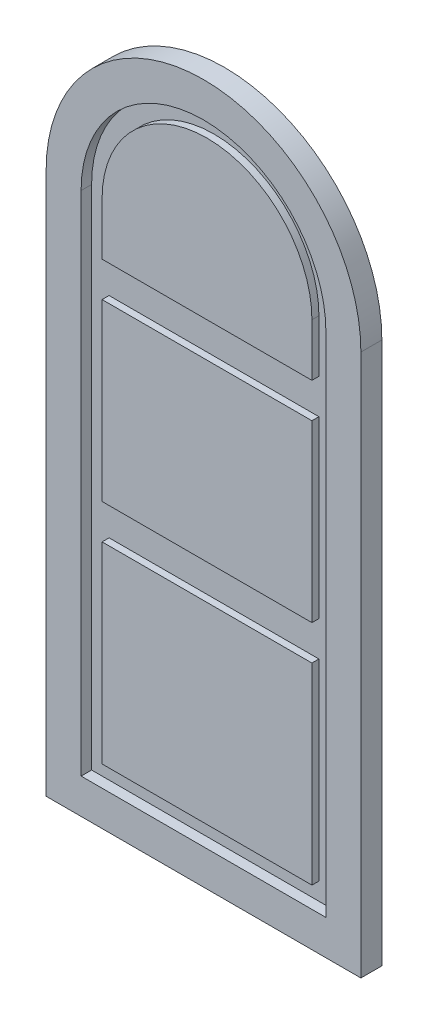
ISO-10303-21;
HEADER;
FILE_DESCRIPTION(('STEP AP214'),'2;1');
FILE_NAME('part.step','',(''),(''),'','','');
FILE_SCHEMA(('AUTOMOTIVE_DESIGN { 1 0 10303 214 1 1 1 1 }'));
ENDSEC;
DATA;
#1=APPLICATION_CONTEXT('core data for automotive mechanical design processes');
#2=APPLICATION_PROTOCOL_DEFINITION('international standard','automotive_design',2000,#1);
#3=PRODUCT_CONTEXT('',#1,'mechanical');
#4=PRODUCT('Part','Part','',(#3));
#5=PRODUCT_RELATED_PRODUCT_CATEGORY('part','',(#4));
#6=PRODUCT_DEFINITION_FORMATION('','',#4);
#7=PRODUCT_DEFINITION_CONTEXT('part definition',#1,'design');
#8=PRODUCT_DEFINITION('design','',#6,#7);
#9=PRODUCT_DEFINITION_SHAPE('','',#8);
#10=(LENGTH_UNIT() NAMED_UNIT(*) SI_UNIT(.MILLI.,.METRE.));
#11=(NAMED_UNIT(*) PLANE_ANGLE_UNIT() SI_UNIT($,.RADIAN.));
#12=(NAMED_UNIT(*) SI_UNIT($,.STERADIAN.) SOLID_ANGLE_UNIT());
#13=UNCERTAINTY_MEASURE_WITH_UNIT(LENGTH_MEASURE(1.E-05),#10,'distance_accuracy_value','');
#14=(GEOMETRIC_REPRESENTATION_CONTEXT(3) GLOBAL_UNCERTAINTY_ASSIGNED_CONTEXT((#13)) GLOBAL_UNIT_ASSIGNED_CONTEXT((#10,
#11,#12)) REPRESENTATION_CONTEXT('',''));
#15=CARTESIAN_POINT('',(0.,0.,0.));
#16=DIRECTION('',(0.,0.,1.));
#17=DIRECTION('',(1.,0.,0.));
#18=AXIS2_PLACEMENT_3D('',#15,#16,#17);
#19=CARTESIAN_POINT('',(405.722904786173,0.,60.));
#20=DIRECTION('',(1.,0.,0.));
#21=DIRECTION('',(0.,0.,-1.));
#22=AXIS2_PLACEMENT_3D('',#19,#20,#21);
#23=PLANE('',#22);
#24=DIRECTION('',(0.,-1.,0.));
#25=VECTOR('',#24,1.);
#26=CARTESIAN_POINT('',(405.722904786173,0.,0.));
#27=LINE('',#26,#25);
#28=CARTESIAN_POINT('',(405.722904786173,463.754283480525,0.));
#29=VERTEX_POINT('',#28);
#30=CARTESIAN_POINT('',(405.722904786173,-1086.24571651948,0.));
#31=VERTEX_POINT('',#30);
#32=EDGE_CURVE('E289',#29,#31,#27,.T.);
#33=ORIENTED_EDGE('',*,*,#32,.F.);
#34=DIRECTION('',(0.,0.,-1.));
#35=VECTOR('',#34,1.);
#36=CARTESIAN_POINT('',(405.722904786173,463.754283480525,60.));
#37=LINE('',#36,#35);
#38=CARTESIAN_POINT('',(405.722904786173,463.754283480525,60.));
#39=VERTEX_POINT('',#38);
#40=EDGE_CURVE('E11',#39,#29,#37,.T.);
#41=ORIENTED_EDGE('',*,*,#40,.F.);
#42=DIRECTION('',(0.,-1.,0.));
#43=VECTOR('',#42,1.);
#44=CARTESIAN_POINT('',(405.722904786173,0.,60.));
#45=LINE('',#44,#43);
#46=CARTESIAN_POINT('',(405.722904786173,-1086.24571651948,60.));
#47=VERTEX_POINT('',#46);
#48=EDGE_CURVE('E302',#39,#47,#45,.T.);
#49=ORIENTED_EDGE('',*,*,#48,.T.);
#50=DIRECTION('',(0.,0.,-1.));
#51=VECTOR('',#50,1.);
#52=CARTESIAN_POINT('',(405.722904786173,-1086.24571651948,60.));
#53=LINE('',#52,#51);
#54=EDGE_CURVE('E324',#47,#31,#53,.T.);
#55=ORIENTED_EDGE('',*,*,#54,.T.);
#56=EDGE_LOOP('',(#33,#41,#49,#55));
#57=FACE_BOUND('',#56,.T.);
#58=ADVANCED_FACE('F34',(#57),#23,.T.);
#59=CARTESIAN_POINT('',(-44.2770952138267,463.754283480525,60.));
#60=DIRECTION('',(0.,0.,-1.));
#61=DIRECTION('',(-1.,0.,0.));
#62=AXIS2_PLACEMENT_3D('',#59,#60,#61);
#63=CYLINDRICAL_SURFACE('',#62,450.);
#64=CARTESIAN_POINT('',(-44.2770952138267,463.754283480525,0.));
#65=DIRECTION('',(0.,0.,1.));
#66=DIRECTION('',(1.,0.,0.));
#67=AXIS2_PLACEMENT_3D('',#64,#65,#66);
#68=CIRCLE('',#67,450.);
#69=CARTESIAN_POINT('',(-494.277095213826,463.754283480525,0.));
#70=VERTEX_POINT('',#69);
#71=EDGE_CURVE('E316',#29,#70,#68,.T.);
#72=ORIENTED_EDGE('',*,*,#71,.T.);
#73=DIRECTION('',(0.,0.,-1.));
#74=VECTOR('',#73,1.);
#75=CARTESIAN_POINT('',(-494.277095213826,463.754283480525,60.));
#76=LINE('',#75,#74);
#77=CARTESIAN_POINT('',(-494.277095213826,463.754283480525,60.));
#78=VERTEX_POINT('',#77);
#79=EDGE_CURVE('E43',#78,#70,#76,.T.);
#80=ORIENTED_EDGE('',*,*,#79,.F.);
#81=CARTESIAN_POINT('',(-44.2770952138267,463.754283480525,60.));
#82=DIRECTION('',(0.,0.,1.));
#83=DIRECTION('',(1.,0.,0.));
#84=AXIS2_PLACEMENT_3D('',#81,#82,#83);
#85=CIRCLE('',#84,450.);
#86=EDGE_CURVE('E305',#39,#78,#85,.T.);
#87=ORIENTED_EDGE('',*,*,#86,.F.);
#88=ORIENTED_EDGE('',*,*,#40,.T.);
#89=EDGE_LOOP('',(#72,#80,#87,#88));
#90=FACE_BOUND('',#89,.T.);
#91=ADVANCED_FACE('F355',(#90),#63,.T.);
#92=CARTESIAN_POINT('',(-494.277095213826,0.,60.));
#93=DIRECTION('',(1.,0.,0.));
#94=DIRECTION('',(0.,1.,0.));
#95=AXIS2_PLACEMENT_3D('',#92,#93,#94);
#96=PLANE('',#95);
#97=DIRECTION('',(0.,-1.,0.));
#98=VECTOR('',#97,1.);
#99=CARTESIAN_POINT('',(-494.277095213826,0.,0.));
#100=LINE('',#99,#98);
#101=CARTESIAN_POINT('',(-494.277095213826,-1086.24571651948,0.));
#102=VERTEX_POINT('',#101);
#103=EDGE_CURVE('E319',#70,#102,#100,.T.);
#104=ORIENTED_EDGE('',*,*,#103,.T.);
#105=DIRECTION('',(0.,0.,-1.));
#106=VECTOR('',#105,1.);
#107=CARTESIAN_POINT('',(-494.277095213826,-1086.24571651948,60.));
#108=LINE('',#107,#106);
#109=CARTESIAN_POINT('',(-494.277095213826,-1086.24571651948,60.));
#110=VERTEX_POINT('',#109);
#111=EDGE_CURVE('E326',#110,#102,#108,.T.);
#112=ORIENTED_EDGE('',*,*,#111,.F.);
#113=DIRECTION('',(0.,-1.,0.));
#114=VECTOR('',#113,1.);
#115=CARTESIAN_POINT('',(-494.277095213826,0.,60.));
#116=LINE('',#115,#114);
#117=EDGE_CURVE('E308',#78,#110,#116,.T.);
#118=ORIENTED_EDGE('',*,*,#117,.F.);
#119=ORIENTED_EDGE('',*,*,#79,.T.);
#120=EDGE_LOOP('',(#104,#112,#118,#119));
#121=FACE_BOUND('',#120,.T.);
#122=ADVANCED_FACE('F350',(#121),#96,.F.);
#123=CARTESIAN_POINT('',(-44.2770952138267,463.754283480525,60.));
#124=DIRECTION('',(0.,0.,-1.));
#125=DIRECTION('',(-1.,0.,0.));
#126=AXIS2_PLACEMENT_3D('',#123,#124,#125);
#127=CYLINDRICAL_SURFACE('',#126,350.);
#128=CARTESIAN_POINT('',(-44.2770952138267,463.754283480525,30.));
#129=DIRECTION('',(0.,0.,1.));
#130=DIRECTION('',(1.,0.,0.));
#131=AXIS2_PLACEMENT_3D('',#128,#129,#130);
#132=CIRCLE('',#131,350.);
#133=CARTESIAN_POINT('',(305.722904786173,463.754283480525,30.));
#134=VERTEX_POINT('',#133);
#135=CARTESIAN_POINT('',(-394.277095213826,463.754283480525,30.));
#136=VERTEX_POINT('',#135);
#137=EDGE_CURVE('E51',#134,#136,#132,.T.);
#138=ORIENTED_EDGE('',*,*,#137,.F.);
#139=DIRECTION('',(0.,0.,-1.));
#140=VECTOR('',#139,1.);
#141=CARTESIAN_POINT('',(305.722904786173,463.754283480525,60.));
#142=LINE('',#141,#140);
#143=CARTESIAN_POINT('',(305.722904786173,463.754283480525,60.));
#144=VERTEX_POINT('',#143);
#145=EDGE_CURVE('E38',#144,#134,#142,.T.);
#146=ORIENTED_EDGE('',*,*,#145,.F.);
#147=CARTESIAN_POINT('',(-44.2770952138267,463.754283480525,60.));
#148=DIRECTION('',(0.,0.,1.));
#149=DIRECTION('',(1.,0.,0.));
#150=AXIS2_PLACEMENT_3D('',#147,#148,#149);
#151=CIRCLE('',#150,350.);
#152=CARTESIAN_POINT('',(-394.277095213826,463.754283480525,60.));
#153=VERTEX_POINT('',#152);
#154=EDGE_CURVE('E290',#144,#153,#151,.T.);
#155=ORIENTED_EDGE('',*,*,#154,.T.);
#156=DIRECTION('',(0.,0.,-1.));
#157=VECTOR('',#156,1.);
#158=CARTESIAN_POINT('',(-394.277095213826,463.754283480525,60.));
#159=LINE('',#158,#157);
#160=EDGE_CURVE('E313',#153,#136,#159,.T.);
#161=ORIENTED_EDGE('',*,*,#160,.T.);
#162=EDGE_LOOP('',(#138,#146,#155,#161));
#163=FACE_BOUND('',#162,.T.);
#164=ADVANCED_FACE('F36',(#163),#127,.F.);
#165=CARTESIAN_POINT('',(305.722904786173,0.,60.));
#166=DIRECTION('',(1.,0.,0.));
#167=DIRECTION('',(0.,0.,-1.));
#168=AXIS2_PLACEMENT_3D('',#165,#166,#167);
#169=PLANE('',#168);
#170=ORIENTED_EDGE('',*,*,#145,.T.);
#171=DIRECTION('',(0.,-1.,0.));
#172=VECTOR('',#171,1.);
#173=CARTESIAN_POINT('',(305.722904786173,0.,30.));
#174=LINE('',#173,#172);
#175=CARTESIAN_POINT('',(305.722904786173,-986.245716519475,30.));
#176=VERTEX_POINT('',#175);
#177=EDGE_CURVE('E58',#134,#176,#174,.T.);
#178=ORIENTED_EDGE('',*,*,#177,.T.);
#179=DIRECTION('',(0.,0.,-1.));
#180=VECTOR('',#179,1.);
#181=CARTESIAN_POINT('',(305.722904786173,-986.245716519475,60.));
#182=LINE('',#181,#180);
#183=CARTESIAN_POINT('',(305.722904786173,-986.245716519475,60.));
#184=VERTEX_POINT('',#183);
#185=EDGE_CURVE('E333',#184,#176,#182,.T.);
#186=ORIENTED_EDGE('',*,*,#185,.F.);
#187=DIRECTION('',(0.,-1.,0.));
#188=VECTOR('',#187,1.);
#189=CARTESIAN_POINT('',(305.722904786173,0.,60.));
#190=LINE('',#189,#188);
#191=EDGE_CURVE('E293',#144,#184,#190,.T.);
#192=ORIENTED_EDGE('',*,*,#191,.F.);
#193=EDGE_LOOP('',(#170,#178,#186,#192));
#194=FACE_BOUND('',#193,.T.);
#195=ADVANCED_FACE('F337',(#194),#169,.F.);
#196=CARTESIAN_POINT('',(1.56421814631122E-13,-986.245716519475,60.));
#197=DIRECTION('',(0.,1.,0.));
#198=DIRECTION('',(-1.,0.,0.));
#199=AXIS2_PLACEMENT_3D('',#196,#197,#198);
#200=PLANE('',#199);
#201=DIRECTION('',(1.,0.,0.));
#202=VECTOR('',#201,1.);
#203=CARTESIAN_POINT('',(1.56421814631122E-13,-986.245716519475,30.));
#204=LINE('',#203,#202);
#205=CARTESIAN_POINT('',(-394.277095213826,-986.245716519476,30.));
#206=VERTEX_POINT('',#205);
#207=EDGE_CURVE('E286',#206,#176,#204,.T.);
#208=ORIENTED_EDGE('',*,*,#207,.F.);
#209=DIRECTION('',(0.,0.,-1.));
#210=VECTOR('',#209,1.);
#211=CARTESIAN_POINT('',(-394.277095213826,-986.245716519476,60.));
#212=LINE('',#211,#210);
#213=CARTESIAN_POINT('',(-394.277095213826,-986.245716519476,60.));
#214=VERTEX_POINT('',#213);
#215=EDGE_CURVE('E332',#214,#206,#212,.T.);
#216=ORIENTED_EDGE('',*,*,#215,.F.);
#217=DIRECTION('',(1.,0.,0.));
#218=VECTOR('',#217,1.);
#219=CARTESIAN_POINT('',(1.56421814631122E-13,-986.245716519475,60.));
#220=LINE('',#219,#218);
#221=EDGE_CURVE('E296',#214,#184,#220,.T.);
#222=ORIENTED_EDGE('',*,*,#221,.T.);
#223=ORIENTED_EDGE('',*,*,#185,.T.);
#224=EDGE_LOOP('',(#208,#216,#222,#223));
#225=FACE_BOUND('',#224,.T.);
#226=ADVANCED_FACE('F341',(#225),#200,.T.);
#227=CARTESIAN_POINT('',(-394.277095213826,0.,60.));
#228=DIRECTION('',(1.,0.,0.));
#229=DIRECTION('',(0.,0.,-1.));
#230=AXIS2_PLACEMENT_3D('',#227,#228,#229);
#231=PLANE('',#230);
#232=DIRECTION('',(0.,-1.,0.));
#233=VECTOR('',#232,1.);
#234=CARTESIAN_POINT('',(-394.277095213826,0.,30.));
#235=LINE('',#234,#233);
#236=EDGE_CURVE('E283',#136,#206,#235,.T.);
#237=ORIENTED_EDGE('',*,*,#236,.F.);
#238=ORIENTED_EDGE('',*,*,#160,.F.);
#239=DIRECTION('',(0.,-1.,0.));
#240=VECTOR('',#239,1.);
#241=CARTESIAN_POINT('',(-394.277095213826,0.,60.));
#242=LINE('',#241,#240);
#243=EDGE_CURVE('E299',#153,#214,#242,.T.);
#244=ORIENTED_EDGE('',*,*,#243,.T.);
#245=ORIENTED_EDGE('',*,*,#215,.T.);
#246=EDGE_LOOP('',(#237,#238,#244,#245));
#247=FACE_BOUND('',#246,.T.);
#248=ADVANCED_FACE('F348',(#247),#231,.T.);
#249=CARTESIAN_POINT('',(0.,-1086.24571651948,60.));
#250=DIRECTION('',(0.,1.,0.));
#251=DIRECTION('',(0.,0.,1.));
#252=AXIS2_PLACEMENT_3D('',#249,#250,#251);
#253=PLANE('',#252);
#254=DIRECTION('',(1.,0.,0.));
#255=VECTOR('',#254,1.);
#256=CARTESIAN_POINT('',(0.,-1086.24571651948,0.));
#257=LINE('',#256,#255);
#258=EDGE_CURVE('E294',#102,#31,#257,.T.);
#259=ORIENTED_EDGE('',*,*,#258,.T.);
#260=ORIENTED_EDGE('',*,*,#54,.F.);
#261=DIRECTION('',(1.,0.,0.));
#262=VECTOR('',#261,1.);
#263=CARTESIAN_POINT('',(0.,-1086.24571651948,60.));
#264=LINE('',#263,#262);
#265=EDGE_CURVE('E311',#110,#47,#264,.T.);
#266=ORIENTED_EDGE('',*,*,#265,.F.);
#267=ORIENTED_EDGE('',*,*,#111,.T.);
#268=EDGE_LOOP('',(#259,#260,#266,#267));
#269=FACE_BOUND('',#268,.T.);
#270=ADVANCED_FACE('F370',(#269),#253,.F.);
#271=CARTESIAN_POINT('',(0.,0.,60.));
#272=DIRECTION('',(0.,0.,1.));
#273=DIRECTION('',(1.,0.,0.));
#274=AXIS2_PLACEMENT_3D('',#271,#272,#273);
#275=PLANE('',#274);
#276=ORIENTED_EDGE('',*,*,#154,.F.);
#277=ORIENTED_EDGE('',*,*,#191,.T.);
#278=ORIENTED_EDGE('',*,*,#221,.F.);
#279=ORIENTED_EDGE('',*,*,#243,.F.);
#280=EDGE_LOOP('',(#276,#277,#278,#279));
#281=FACE_BOUND('',#280,.T.);
#282=ORIENTED_EDGE('',*,*,#48,.F.);
#283=ORIENTED_EDGE('',*,*,#86,.T.);
#284=ORIENTED_EDGE('',*,*,#117,.T.);
#285=ORIENTED_EDGE('',*,*,#265,.T.);
#286=EDGE_LOOP('',(#282,#283,#284,#285));
#287=FACE_BOUND('',#286,.T.);
#288=ADVANCED_FACE('F346',(#281,#287),#275,.T.);
#289=CARTESIAN_POINT('',(0.,0.,0.));
#290=DIRECTION('',(0.,0.,1.));
#291=DIRECTION('',(1.,0.,0.));
#292=AXIS2_PLACEMENT_3D('',#289,#290,#291);
#293=PLANE('',#292);
#294=ORIENTED_EDGE('',*,*,#32,.T.);
#295=ORIENTED_EDGE('',*,*,#258,.F.);
#296=ORIENTED_EDGE('',*,*,#103,.F.);
#297=ORIENTED_EDGE('',*,*,#71,.F.);
#298=EDGE_LOOP('',(#294,#295,#296,#297));
#299=FACE_BOUND('',#298,.T.);
#300=ADVANCED_FACE('F395',(#299),#293,.F.);
#301=CARTESIAN_POINT('',(0.,0.,30.));
#302=DIRECTION('',(0.,0.,1.));
#303=DIRECTION('',(1.,0.,0.));
#304=AXIS2_PLACEMENT_3D('',#301,#302,#303);
#305=PLANE('',#304);
#306=CARTESIAN_POINT('',(-44.2770952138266,463.754283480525,30.));
#307=DIRECTION('',(0.,0.,1.));
#308=DIRECTION('',(1.,0.,0.));
#309=AXIS2_PLACEMENT_3D('',#306,#307,#308);
#310=CIRCLE('',#309,300.);
#311=CARTESIAN_POINT('',(255.722904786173,463.754283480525,30.));
#312=VERTEX_POINT('',#311);
#313=CARTESIAN_POINT('',(-344.277095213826,463.754283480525,30.));
#314=VERTEX_POINT('',#313);
#315=EDGE_CURVE('E251',#312,#314,#310,.T.);
#316=ORIENTED_EDGE('',*,*,#315,.F.);
#317=DIRECTION('',(0.,1.,0.));
#318=VECTOR('',#317,1.);
#319=CARTESIAN_POINT('',(255.722904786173,0.,30.));
#320=LINE('',#319,#318);
#321=CARTESIAN_POINT('',(255.722904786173,313.754283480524,30.));
#322=VERTEX_POINT('',#321);
#323=EDGE_CURVE('E254',#322,#312,#320,.T.);
#324=ORIENTED_EDGE('',*,*,#323,.F.);
#325=DIRECTION('',(1.,0.,0.));
#326=VECTOR('',#325,1.);
#327=CARTESIAN_POINT('',(0.,313.754283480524,30.));
#328=LINE('',#327,#326);
#329=CARTESIAN_POINT('',(-344.277095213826,313.754283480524,30.));
#330=VERTEX_POINT('',#329);
#331=EDGE_CURVE('E257',#330,#322,#328,.T.);
#332=ORIENTED_EDGE('',*,*,#331,.F.);
#333=DIRECTION('',(0.,1.,0.));
#334=VECTOR('',#333,1.);
#335=CARTESIAN_POINT('',(-344.277095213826,0.,30.));
#336=LINE('',#335,#334);
#337=EDGE_CURVE('E260',#330,#314,#336,.T.);
#338=ORIENTED_EDGE('',*,*,#337,.T.);
#339=EDGE_LOOP('',(#316,#324,#332,#338));
#340=FACE_BOUND('',#339,.T.);
#341=DIRECTION('',(1.,0.,0.));
#342=VECTOR('',#341,1.);
#343=CARTESIAN_POINT('',(0.,-936.245716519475,30.));
#344=LINE('',#343,#342);
#345=CARTESIAN_POINT('',(-344.277095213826,-936.245716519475,30.));
#346=VERTEX_POINT('',#345);
#347=CARTESIAN_POINT('',(255.722904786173,-936.245716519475,30.));
#348=VERTEX_POINT('',#347);
#349=EDGE_CURVE('E262',#346,#348,#344,.T.);
#350=ORIENTED_EDGE('',*,*,#349,.F.);
#351=DIRECTION('',(0.,1.,0.));
#352=VECTOR('',#351,1.);
#353=CARTESIAN_POINT('',(-344.277095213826,0.,30.));
#354=LINE('',#353,#352);
#355=CARTESIAN_POINT('',(-344.277095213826,-386.245716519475,30.));
#356=VERTEX_POINT('',#355);
#357=EDGE_CURVE('E182',#346,#356,#354,.T.);
#358=ORIENTED_EDGE('',*,*,#357,.T.);
#359=DIRECTION('',(1.,0.,0.));
#360=VECTOR('',#359,1.);
#361=CARTESIAN_POINT('',(0.,-386.245716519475,30.));
#362=LINE('',#361,#360);
#363=CARTESIAN_POINT('',(255.722904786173,-386.245716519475,30.));
#364=VERTEX_POINT('',#363);
#365=EDGE_CURVE('E265',#356,#364,#362,.T.);
#366=ORIENTED_EDGE('',*,*,#365,.T.);
#367=DIRECTION('',(0.,1.,0.));
#368=VECTOR('',#367,1.);
#369=CARTESIAN_POINT('',(255.722904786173,0.,30.));
#370=LINE('',#369,#368);
#371=EDGE_CURVE('E268',#348,#364,#370,.T.);
#372=ORIENTED_EDGE('',*,*,#371,.F.);
#373=EDGE_LOOP('',(#350,#358,#366,#372));
#374=FACE_BOUND('',#373,.T.);
#375=DIRECTION('',(0.,1.,0.));
#376=VECTOR('',#375,1.);
#377=CARTESIAN_POINT('',(255.722904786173,0.,30.));
#378=LINE('',#377,#376);
#379=CARTESIAN_POINT('',(255.722904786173,-286.245716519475,30.));
#380=VERTEX_POINT('',#379);
#381=CARTESIAN_POINT('',(255.722904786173,213.754283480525,30.));
#382=VERTEX_POINT('',#381);
#383=EDGE_CURVE('E271',#380,#382,#378,.T.);
#384=ORIENTED_EDGE('',*,*,#383,.F.);
#385=DIRECTION('',(1.,0.,0.));
#386=VECTOR('',#385,1.);
#387=CARTESIAN_POINT('',(0.,-286.245716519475,30.));
#388=LINE('',#387,#386);
#389=CARTESIAN_POINT('',(-344.277095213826,-286.245716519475,30.));
#390=VERTEX_POINT('',#389);
#391=EDGE_CURVE('E273',#390,#380,#388,.T.);
#392=ORIENTED_EDGE('',*,*,#391,.F.);
#393=DIRECTION('',(0.,1.,0.));
#394=VECTOR('',#393,1.);
#395=CARTESIAN_POINT('',(-344.277095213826,0.,30.));
#396=LINE('',#395,#394);
#397=CARTESIAN_POINT('',(-344.277095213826,213.754283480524,30.));
#398=VERTEX_POINT('',#397);
#399=EDGE_CURVE('E275',#390,#398,#396,.T.);
#400=ORIENTED_EDGE('',*,*,#399,.T.);
#401=DIRECTION('',(1.,0.,0.));
#402=VECTOR('',#401,1.);
#403=CARTESIAN_POINT('',(0.,213.754283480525,30.));
#404=LINE('',#403,#402);
#405=EDGE_CURVE('E278',#398,#382,#404,.T.);
#406=ORIENTED_EDGE('',*,*,#405,.T.);
#407=EDGE_LOOP('',(#384,#392,#400,#406));
#408=FACE_BOUND('',#407,.T.);
#409=ORIENTED_EDGE('',*,*,#177,.F.);
#410=ORIENTED_EDGE('',*,*,#137,.T.);
#411=ORIENTED_EDGE('',*,*,#236,.T.);
#412=ORIENTED_EDGE('',*,*,#207,.T.);
#413=EDGE_LOOP('',(#409,#410,#411,#412));
#414=FACE_BOUND('',#413,.T.);
#415=ADVANCED_FACE('F340',(#340,#374,#408,#414),#305,.T.);
#416=CARTESIAN_POINT('',(0.,0.,50.));
#417=DIRECTION('',(0.,0.,1.));
#418=DIRECTION('',(1.,0.,0.));
#419=AXIS2_PLACEMENT_3D('',#416,#417,#418);
#420=PLANE('',#419);
#421=DIRECTION('',(0.,1.,0.));
#422=VECTOR('',#421,1.);
#423=CARTESIAN_POINT('',(255.722904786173,0.,50.));
#424=LINE('',#423,#422);
#425=CARTESIAN_POINT('',(255.722904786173,313.754283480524,50.));
#426=VERTEX_POINT('',#425);
#427=CARTESIAN_POINT('',(255.722904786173,463.754283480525,50.));
#428=VERTEX_POINT('',#427);
#429=EDGE_CURVE('E229',#426,#428,#424,.T.);
#430=ORIENTED_EDGE('',*,*,#429,.T.);
#431=CARTESIAN_POINT('',(-44.2770952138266,463.754283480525,50.));
#432=DIRECTION('',(0.,0.,1.));
#433=DIRECTION('',(1.,0.,0.));
#434=AXIS2_PLACEMENT_3D('',#431,#432,#433);
#435=CIRCLE('',#434,300.);
#436=CARTESIAN_POINT('',(-344.277095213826,463.754283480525,50.));
#437=VERTEX_POINT('',#436);
#438=EDGE_CURVE('E232',#428,#437,#435,.T.);
#439=ORIENTED_EDGE('',*,*,#438,.T.);
#440=DIRECTION('',(0.,1.,0.));
#441=VECTOR('',#440,1.);
#442=CARTESIAN_POINT('',(-344.277095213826,0.,50.));
#443=LINE('',#442,#441);
#444=CARTESIAN_POINT('',(-344.277095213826,313.754283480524,50.));
#445=VERTEX_POINT('',#444);
#446=EDGE_CURVE('E234',#445,#437,#443,.T.);
#447=ORIENTED_EDGE('',*,*,#446,.F.);
#448=DIRECTION('',(1.,0.,0.));
#449=VECTOR('',#448,1.);
#450=CARTESIAN_POINT('',(0.,313.754283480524,50.));
#451=LINE('',#450,#449);
#452=EDGE_CURVE('E237',#445,#426,#451,.T.);
#453=ORIENTED_EDGE('',*,*,#452,.T.);
#454=EDGE_LOOP('',(#430,#439,#447,#453));
#455=FACE_BOUND('',#454,.T.);
#456=ADVANCED_FACE('F408',(#455),#420,.T.);
#457=CARTESIAN_POINT('',(0.,313.754283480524,50.));
#458=DIRECTION('',(0.,1.,0.));
#459=DIRECTION('',(0.,0.,1.));
#460=AXIS2_PLACEMENT_3D('',#457,#458,#459);
#461=PLANE('',#460);
#462=ORIENTED_EDGE('',*,*,#331,.T.);
#463=DIRECTION('',(0.,0.,-1.));
#464=VECTOR('',#463,1.);
#465=CARTESIAN_POINT('',(255.722904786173,313.754283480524,50.));
#466=LINE('',#465,#464);
#467=EDGE_CURVE('E239',#426,#322,#466,.T.);
#468=ORIENTED_EDGE('',*,*,#467,.F.);
#469=ORIENTED_EDGE('',*,*,#452,.F.);
#470=DIRECTION('',(0.,0.,-1.));
#471=VECTOR('',#470,1.);
#472=CARTESIAN_POINT('',(-344.277095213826,313.754283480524,50.));
#473=LINE('',#472,#471);
#474=EDGE_CURVE('E242',#445,#330,#473,.T.);
#475=ORIENTED_EDGE('',*,*,#474,.T.);
#476=EDGE_LOOP('',(#462,#468,#469,#475));
#477=FACE_BOUND('',#476,.T.);
#478=ADVANCED_FACE('F416',(#477),#461,.F.);
#479=CARTESIAN_POINT('',(-344.277095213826,0.,50.));
#480=DIRECTION('',(-1.,0.,0.));
#481=DIRECTION('',(0.,0.,1.));
#482=AXIS2_PLACEMENT_3D('',#479,#480,#481);
#483=PLANE('',#482);
#484=DIRECTION('',(0.,0.,-1.));
#485=VECTOR('',#484,1.);
#486=CARTESIAN_POINT('',(-344.277095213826,463.754283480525,50.));
#487=LINE('',#486,#485);
#488=EDGE_CURVE('E245',#437,#314,#487,.T.);
#489=ORIENTED_EDGE('',*,*,#488,.T.);
#490=ORIENTED_EDGE('',*,*,#337,.F.);
#491=ORIENTED_EDGE('',*,*,#474,.F.);
#492=ORIENTED_EDGE('',*,*,#446,.T.);
#493=EDGE_LOOP('',(#489,#490,#491,#492));
#494=FACE_BOUND('',#493,.T.);
#495=ADVANCED_FACE('F424',(#494),#483,.T.);
#496=CARTESIAN_POINT('',(-44.2770952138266,463.754283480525,50.));
#497=DIRECTION('',(0.,0.,-1.));
#498=DIRECTION('',(-1.,0.,0.));
#499=AXIS2_PLACEMENT_3D('',#496,#497,#498);
#500=CYLINDRICAL_SURFACE('',#499,300.);
#501=ORIENTED_EDGE('',*,*,#315,.T.);
#502=ORIENTED_EDGE('',*,*,#488,.F.);
#503=ORIENTED_EDGE('',*,*,#438,.F.);
#504=DIRECTION('',(0.,0.,-1.));
#505=VECTOR('',#504,1.);
#506=CARTESIAN_POINT('',(255.722904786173,463.754283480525,50.));
#507=LINE('',#506,#505);
#508=EDGE_CURVE('E248',#428,#312,#507,.T.);
#509=ORIENTED_EDGE('',*,*,#508,.T.);
#510=EDGE_LOOP('',(#501,#502,#503,#509));
#511=FACE_BOUND('',#510,.T.);
#512=ADVANCED_FACE('F432',(#511),#500,.T.);
#513=CARTESIAN_POINT('',(255.722904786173,0.,50.));
#514=DIRECTION('',(-1.,0.,0.));
#515=DIRECTION('',(0.,0.,1.));
#516=AXIS2_PLACEMENT_3D('',#513,#514,#515);
#517=PLANE('',#516);
#518=ORIENTED_EDGE('',*,*,#323,.T.);
#519=ORIENTED_EDGE('',*,*,#508,.F.);
#520=ORIENTED_EDGE('',*,*,#429,.F.);
#521=ORIENTED_EDGE('',*,*,#467,.T.);
#522=EDGE_LOOP('',(#518,#519,#520,#521));
#523=FACE_BOUND('',#522,.T.);
#524=ADVANCED_FACE('F440',(#523),#517,.F.);
#525=CARTESIAN_POINT('',(0.,0.,50.));
#526=DIRECTION('',(0.,0.,1.));
#527=DIRECTION('',(1.,0.,0.));
#528=AXIS2_PLACEMENT_3D('',#525,#526,#527);
#529=PLANE('',#528);
#530=DIRECTION('',(1.,0.,0.));
#531=VECTOR('',#530,1.);
#532=CARTESIAN_POINT('',(0.,-286.245716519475,50.));
#533=LINE('',#532,#531);
#534=CARTESIAN_POINT('',(-344.277095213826,-286.245716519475,50.));
#535=VERTEX_POINT('',#534);
#536=CARTESIAN_POINT('',(255.722904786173,-286.245716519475,50.));
#537=VERTEX_POINT('',#536);
#538=EDGE_CURVE('E185',#535,#537,#533,.T.);
#539=ORIENTED_EDGE('',*,*,#538,.T.);
#540=DIRECTION('',(0.,1.,0.));
#541=VECTOR('',#540,1.);
#542=CARTESIAN_POINT('',(255.722904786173,0.,50.));
#543=LINE('',#542,#541);
#544=CARTESIAN_POINT('',(255.722904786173,213.754283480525,50.));
#545=VERTEX_POINT('',#544);
#546=EDGE_CURVE('E210',#537,#545,#543,.T.);
#547=ORIENTED_EDGE('',*,*,#546,.T.);
#548=DIRECTION('',(1.,0.,0.));
#549=VECTOR('',#548,1.);
#550=CARTESIAN_POINT('',(0.,213.754283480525,50.));
#551=LINE('',#550,#549);
#552=CARTESIAN_POINT('',(-344.277095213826,213.754283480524,50.));
#553=VERTEX_POINT('',#552);
#554=EDGE_CURVE('E212',#553,#545,#551,.T.);
#555=ORIENTED_EDGE('',*,*,#554,.F.);
#556=DIRECTION('',(0.,1.,0.));
#557=VECTOR('',#556,1.);
#558=CARTESIAN_POINT('',(-344.277095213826,0.,50.));
#559=LINE('',#558,#557);
#560=EDGE_CURVE('E215',#535,#553,#559,.T.);
#561=ORIENTED_EDGE('',*,*,#560,.F.);
#562=EDGE_LOOP('',(#539,#547,#555,#561));
#563=FACE_BOUND('',#562,.T.);
#564=ADVANCED_FACE('F448',(#563),#529,.T.);
#565=CARTESIAN_POINT('',(-344.277095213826,0.,50.));
#566=DIRECTION('',(-1.,0.,0.));
#567=DIRECTION('',(0.,0.,1.));
#568=AXIS2_PLACEMENT_3D('',#565,#566,#567);
#569=PLANE('',#568);
#570=DIRECTION('',(0.,0.,-1.));
#571=VECTOR('',#570,1.);
#572=CARTESIAN_POINT('',(-344.277095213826,213.754283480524,50.));
#573=LINE('',#572,#571);
#574=EDGE_CURVE('E221',#553,#398,#573,.T.);
#575=ORIENTED_EDGE('',*,*,#574,.T.);
#576=ORIENTED_EDGE('',*,*,#399,.F.);
#577=DIRECTION('',(0.,0.,-1.));
#578=VECTOR('',#577,1.);
#579=CARTESIAN_POINT('',(-344.277095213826,-286.245716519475,50.));
#580=LINE('',#579,#578);
#581=EDGE_CURVE('E218',#535,#390,#580,.T.);
#582=ORIENTED_EDGE('',*,*,#581,.F.);
#583=ORIENTED_EDGE('',*,*,#560,.T.);
#584=EDGE_LOOP('',(#575,#576,#582,#583));
#585=FACE_BOUND('',#584,.T.);
#586=ADVANCED_FACE('F456',(#585),#569,.T.);
#587=CARTESIAN_POINT('',(0.,213.754283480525,50.));
#588=DIRECTION('',(0.,1.,0.));
#589=DIRECTION('',(-1.,0.,0.));
#590=AXIS2_PLACEMENT_3D('',#587,#588,#589);
#591=PLANE('',#590);
#592=DIRECTION('',(0.,0.,-1.));
#593=VECTOR('',#592,1.);
#594=CARTESIAN_POINT('',(255.722904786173,213.754283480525,50.));
#595=LINE('',#594,#593);
#596=EDGE_CURVE('E223',#545,#382,#595,.T.);
#597=ORIENTED_EDGE('',*,*,#596,.T.);
#598=ORIENTED_EDGE('',*,*,#405,.F.);
#599=ORIENTED_EDGE('',*,*,#574,.F.);
#600=ORIENTED_EDGE('',*,*,#554,.T.);
#601=EDGE_LOOP('',(#597,#598,#599,#600));
#602=FACE_BOUND('',#601,.T.);
#603=ADVANCED_FACE('F464',(#602),#591,.T.);
#604=CARTESIAN_POINT('',(255.722904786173,0.,50.));
#605=DIRECTION('',(-1.,0.,0.));
#606=DIRECTION('',(0.,-1.,0.));
#607=AXIS2_PLACEMENT_3D('',#604,#605,#606);
#608=PLANE('',#607);
#609=ORIENTED_EDGE('',*,*,#383,.T.);
#610=ORIENTED_EDGE('',*,*,#596,.F.);
#611=ORIENTED_EDGE('',*,*,#546,.F.);
#612=DIRECTION('',(0.,0.,-1.));
#613=VECTOR('',#612,1.);
#614=CARTESIAN_POINT('',(255.722904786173,-286.245716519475,50.));
#615=LINE('',#614,#613);
#616=EDGE_CURVE('E226',#537,#380,#615,.T.);
#617=ORIENTED_EDGE('',*,*,#616,.T.);
#618=EDGE_LOOP('',(#609,#610,#611,#617));
#619=FACE_BOUND('',#618,.T.);
#620=ADVANCED_FACE('F472',(#619),#608,.F.);
#621=CARTESIAN_POINT('',(0.,-286.245716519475,50.));
#622=DIRECTION('',(0.,1.,0.));
#623=DIRECTION('',(0.,0.,1.));
#624=AXIS2_PLACEMENT_3D('',#621,#622,#623);
#625=PLANE('',#624);
#626=ORIENTED_EDGE('',*,*,#391,.T.);
#627=ORIENTED_EDGE('',*,*,#616,.F.);
#628=ORIENTED_EDGE('',*,*,#538,.F.);
#629=ORIENTED_EDGE('',*,*,#581,.T.);
#630=EDGE_LOOP('',(#626,#627,#628,#629));
#631=FACE_BOUND('',#630,.T.);
#632=ADVANCED_FACE('F480',(#631),#625,.F.);
#633=CARTESIAN_POINT('',(0.,0.,50.));
#634=DIRECTION('',(0.,0.,1.));
#635=DIRECTION('',(1.,0.,0.));
#636=AXIS2_PLACEMENT_3D('',#633,#634,#635);
#637=PLANE('',#636);
#638=DIRECTION('',(0.,1.,0.));
#639=VECTOR('',#638,1.);
#640=CARTESIAN_POINT('',(-344.277095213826,0.,50.));
#641=LINE('',#640,#639);
#642=CARTESIAN_POINT('',(-344.277095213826,-936.245716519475,50.));
#643=VERTEX_POINT('',#642);
#644=CARTESIAN_POINT('',(-344.277095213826,-386.245716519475,50.));
#645=VERTEX_POINT('',#644);
#646=EDGE_CURVE('E179',#643,#645,#641,.T.);
#647=ORIENTED_EDGE('',*,*,#646,.F.);
#648=DIRECTION('',(1.,0.,0.));
#649=VECTOR('',#648,1.);
#650=CARTESIAN_POINT('',(0.,-936.245716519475,50.));
#651=LINE('',#650,#649);
#652=CARTESIAN_POINT('',(255.722904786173,-936.245716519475,50.));
#653=VERTEX_POINT('',#652);
#654=EDGE_CURVE('E189',#643,#653,#651,.T.);
#655=ORIENTED_EDGE('',*,*,#654,.T.);
#656=DIRECTION('',(0.,1.,0.));
#657=VECTOR('',#656,1.);
#658=CARTESIAN_POINT('',(255.722904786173,0.,50.));
#659=LINE('',#658,#657);
#660=CARTESIAN_POINT('',(255.722904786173,-386.245716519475,50.));
#661=VERTEX_POINT('',#660);
#662=EDGE_CURVE('E194',#653,#661,#659,.T.);
#663=ORIENTED_EDGE('',*,*,#662,.T.);
#664=DIRECTION('',(1.,0.,0.));
#665=VECTOR('',#664,1.);
#666=CARTESIAN_POINT('',(0.,-386.245716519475,50.));
#667=LINE('',#666,#665);
#668=EDGE_CURVE('E198',#645,#661,#667,.T.);
#669=ORIENTED_EDGE('',*,*,#668,.F.);
#670=EDGE_LOOP('',(#647,#655,#663,#669));
#671=FACE_BOUND('',#670,.T.);
#672=ADVANCED_FACE('F196',(#671),#637,.T.);
#673=CARTESIAN_POINT('',(0.,-386.245716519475,50.));
#674=DIRECTION('',(0.,1.,0.));
#675=DIRECTION('',(0.,0.,1.));
#676=AXIS2_PLACEMENT_3D('',#673,#674,#675);
#677=PLANE('',#676);
#678=DIRECTION('',(0.,0.,-1.));
#679=VECTOR('',#678,1.);
#680=CARTESIAN_POINT('',(255.722904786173,-386.245716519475,50.));
#681=LINE('',#680,#679);
#682=EDGE_CURVE('E205',#661,#364,#681,.T.);
#683=ORIENTED_EDGE('',*,*,#682,.T.);
#684=ORIENTED_EDGE('',*,*,#365,.F.);
#685=DIRECTION('',(0.,0.,-1.));
#686=VECTOR('',#685,1.);
#687=CARTESIAN_POINT('',(-344.277095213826,-386.245716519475,50.));
#688=LINE('',#687,#686);
#689=EDGE_CURVE('E203',#645,#356,#688,.T.);
#690=ORIENTED_EDGE('',*,*,#689,.F.);
#691=ORIENTED_EDGE('',*,*,#668,.T.);
#692=EDGE_LOOP('',(#683,#684,#690,#691));
#693=FACE_BOUND('',#692,.T.);
#694=ADVANCED_FACE('F495',(#693),#677,.T.);
#695=CARTESIAN_POINT('',(255.722904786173,0.,50.));
#696=DIRECTION('',(-1.,0.,0.));
#697=DIRECTION('',(0.,0.,1.));
#698=AXIS2_PLACEMENT_3D('',#695,#696,#697);
#699=PLANE('',#698);
#700=ORIENTED_EDGE('',*,*,#371,.T.);
#701=ORIENTED_EDGE('',*,*,#682,.F.);
#702=ORIENTED_EDGE('',*,*,#662,.F.);
#703=DIRECTION('',(0.,0.,-1.));
#704=VECTOR('',#703,1.);
#705=CARTESIAN_POINT('',(255.722904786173,-936.245716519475,50.));
#706=LINE('',#705,#704);
#707=EDGE_CURVE('E186',#653,#348,#706,.T.);
#708=ORIENTED_EDGE('',*,*,#707,.T.);
#709=EDGE_LOOP('',(#700,#701,#702,#708));
#710=FACE_BOUND('',#709,.T.);
#711=ADVANCED_FACE('F502',(#710),#699,.F.);
#712=CARTESIAN_POINT('',(0.,-936.245716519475,50.));
#713=DIRECTION('',(0.,1.,0.));
#714=DIRECTION('',(0.,0.,1.));
#715=AXIS2_PLACEMENT_3D('',#712,#713,#714);
#716=PLANE('',#715);
#717=ORIENTED_EDGE('',*,*,#349,.T.);
#718=ORIENTED_EDGE('',*,*,#707,.F.);
#719=ORIENTED_EDGE('',*,*,#654,.F.);
#720=DIRECTION('',(0.,0.,-1.));
#721=VECTOR('',#720,1.);
#722=CARTESIAN_POINT('',(-344.277095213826,-936.245716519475,50.));
#723=LINE('',#722,#721);
#724=EDGE_CURVE('E174',#643,#346,#723,.T.);
#725=ORIENTED_EDGE('',*,*,#724,.T.);
#726=EDGE_LOOP('',(#717,#718,#719,#725));
#727=FACE_BOUND('',#726,.T.);
#728=ADVANCED_FACE('F190',(#727),#716,.F.);
#729=CARTESIAN_POINT('',(-344.277095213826,0.,50.));
#730=DIRECTION('',(-1.,0.,0.));
#731=DIRECTION('',(0.,0.,1.));
#732=AXIS2_PLACEMENT_3D('',#729,#730,#731);
#733=PLANE('',#732);
#734=ORIENTED_EDGE('',*,*,#689,.T.);
#735=ORIENTED_EDGE('',*,*,#357,.F.);
#736=ORIENTED_EDGE('',*,*,#724,.F.);
#737=ORIENTED_EDGE('',*,*,#646,.T.);
#738=EDGE_LOOP('',(#734,#735,#736,#737));
#739=FACE_BOUND('',#738,.T.);
#740=ADVANCED_FACE('F177',(#739),#733,.T.);
#741=CLOSED_SHELL('',(#58,#91,#122,#164,#195,#226,#248,#270,#288,#300,#415,#456,#478,#495,#512,
#524,#564,#586,#603,#620,#632,#672,#694,#711,#728,#740));
#742=MANIFOLD_SOLID_BREP('B2',#741);
#743=ADVANCED_BREP_SHAPE_REPRESENTATION('',(#18,#742),#14);
#744=SHAPE_DEFINITION_REPRESENTATION(#9,#743);
ENDSEC;
END-ISO-10303-21;
